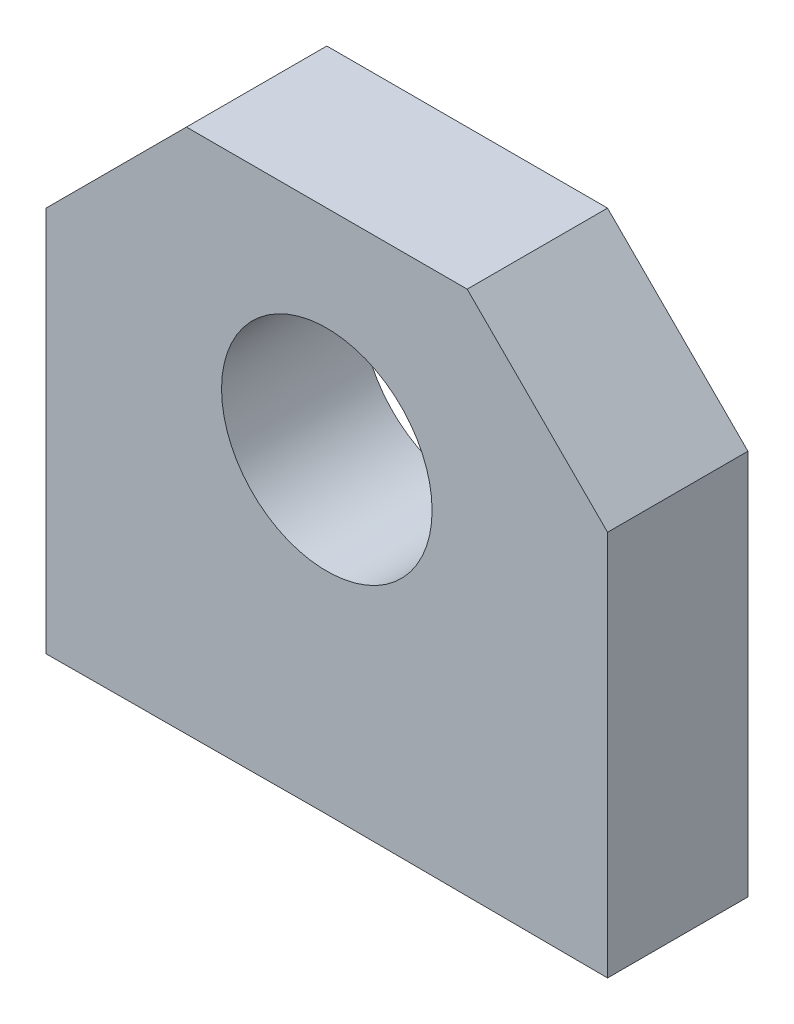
ISO-10303-21;
HEADER;
FILE_DESCRIPTION(('STEP AP214'),'2;1');
FILE_NAME('part.step','',(''),(''),'','','');
FILE_SCHEMA(('AUTOMOTIVE_DESIGN { 1 0 10303 214 1 1 1 1 }'));
ENDSEC;
DATA;
#1=APPLICATION_CONTEXT('core data for automotive mechanical design processes');
#2=APPLICATION_PROTOCOL_DEFINITION('international standard','automotive_design',2000,#1);
#3=PRODUCT_CONTEXT('',#1,'mechanical');
#4=PRODUCT('Part','Part','',(#3));
#5=PRODUCT_RELATED_PRODUCT_CATEGORY('part','',(#4));
#6=PRODUCT_DEFINITION_FORMATION('','',#4);
#7=PRODUCT_DEFINITION_CONTEXT('part definition',#1,'design');
#8=PRODUCT_DEFINITION('design','',#6,#7);
#9=PRODUCT_DEFINITION_SHAPE('','',#8);
#10=(LENGTH_UNIT() NAMED_UNIT(*) SI_UNIT(.MILLI.,.METRE.));
#11=(NAMED_UNIT(*) PLANE_ANGLE_UNIT() SI_UNIT($,.RADIAN.));
#12=(NAMED_UNIT(*) SI_UNIT($,.STERADIAN.) SOLID_ANGLE_UNIT());
#13=UNCERTAINTY_MEASURE_WITH_UNIT(LENGTH_MEASURE(1.E-05),#10,'distance_accuracy_value','');
#14=(GEOMETRIC_REPRESENTATION_CONTEXT(3) GLOBAL_UNCERTAINTY_ASSIGNED_CONTEXT((#13)) GLOBAL_UNIT_ASSIGNED_CONTEXT((#10,
#11,#12)) REPRESENTATION_CONTEXT('',''));
#15=CARTESIAN_POINT('',(0.,0.,0.));
#16=DIRECTION('',(0.,0.,1.));
#17=DIRECTION('',(1.,0.,0.));
#18=AXIS2_PLACEMENT_3D('',#15,#16,#17);
#19=CARTESIAN_POINT('',(16.,8.,8.));
#20=DIRECTION('',(0.,0.,1.));
#21=DIRECTION('',(1.,0.,0.));
#22=AXIS2_PLACEMENT_3D('',#19,#20,#21);
#23=PLANE('',#22);
#24=DIRECTION('',(0.999988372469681,-0.00482233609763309,0.));
#25=VECTOR('',#24,1.);
#26=CARTESIAN_POINT('',(0.,8.07715827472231,8.));
#27=LINE('',#26,#25);
#28=CARTESIAN_POINT('',(0.,8.07715827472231,8.));
#29=VERTEX_POINT('',#28);
#30=CARTESIAN_POINT('',(16.,8.,8.));
#31=VERTEX_POINT('',#30);
#32=EDGE_CURVE('E134',#29,#31,#27,.T.);
#33=ORIENTED_EDGE('',*,*,#32,.T.);
#34=DIRECTION('',(0.,1.,0.));
#35=VECTOR('',#34,1.);
#36=CARTESIAN_POINT('',(16.,8.,8.));
#37=LINE('',#36,#35);
#38=CARTESIAN_POINT('',(16.,30.,8.));
#39=VERTEX_POINT('',#38);
#40=EDGE_CURVE('E87',#31,#39,#37,.T.);
#41=ORIENTED_EDGE('',*,*,#40,.T.);
#42=DIRECTION('',(-0.707106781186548,0.707106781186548,0.));
#43=VECTOR('',#42,1.);
#44=CARTESIAN_POINT('',(16.,30.,8.));
#45=LINE('',#44,#43);
#46=CARTESIAN_POINT('',(8.,38.,8.));
#47=VERTEX_POINT('',#46);
#48=EDGE_CURVE('E146',#39,#47,#45,.T.);
#49=ORIENTED_EDGE('',*,*,#48,.T.);
#50=DIRECTION('',(-1.,0.,0.));
#51=VECTOR('',#50,1.);
#52=CARTESIAN_POINT('',(-8.,38.,8.));
#53=LINE('',#52,#51);
#54=CARTESIAN_POINT('',(-8.,38.,8.));
#55=VERTEX_POINT('',#54);
#56=EDGE_CURVE('E103',#47,#55,#53,.T.);
#57=ORIENTED_EDGE('',*,*,#56,.T.);
#58=DIRECTION('',(-0.707106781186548,-0.707106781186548,0.));
#59=VECTOR('',#58,1.);
#60=CARTESIAN_POINT('',(-16.,30.,8.));
#61=LINE('',#60,#59);
#62=CARTESIAN_POINT('',(-16.,30.,8.));
#63=VERTEX_POINT('',#62);
#64=EDGE_CURVE('E97',#55,#63,#61,.T.);
#65=ORIENTED_EDGE('',*,*,#64,.T.);
#66=DIRECTION('',(0.,-1.,0.));
#67=VECTOR('',#66,1.);
#68=CARTESIAN_POINT('',(-16.,8.,8.));
#69=LINE('',#68,#67);
#70=CARTESIAN_POINT('',(-16.,8.,8.));
#71=VERTEX_POINT('',#70);
#72=EDGE_CURVE('E101',#63,#71,#69,.T.);
#73=ORIENTED_EDGE('',*,*,#72,.T.);
#74=DIRECTION('',(0.999988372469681,0.00482233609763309,0.));
#75=VECTOR('',#74,1.);
#76=CARTESIAN_POINT('',(0.,8.07715827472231,8.));
#77=LINE('',#76,#75);
#78=EDGE_CURVE('E47',#71,#29,#77,.T.);
#79=ORIENTED_EDGE('',*,*,#78,.T.);
#80=EDGE_LOOP('',(#33,#41,#49,#57,#65,#73,#79));
#81=FACE_BOUND('',#80,.T.);
#82=CARTESIAN_POINT('',(0.,26.0771582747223,8.));
#83=DIRECTION('',(0.,0.,1.));
#84=DIRECTION('',(1.,0.,0.));
#85=AXIS2_PLACEMENT_3D('',#82,#83,#84);
#86=CIRCLE('',#85,6.);
#87=CARTESIAN_POINT('',(6.,26.0771582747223,8.));
#88=VERTEX_POINT('',#87);
#89=EDGE_CURVE('E125',#88,#88,#86,.T.);
#90=ORIENTED_EDGE('',*,*,#89,.F.);
#91=EDGE_LOOP('',(#90));
#92=FACE_BOUND('',#91,.T.);
#93=ADVANCED_FACE('F30',(#81,#92),#23,.T.);
#94=CARTESIAN_POINT('',(16.,8.,0.));
#95=DIRECTION('',(0.,0.,1.));
#96=DIRECTION('',(1.,0.,0.));
#97=AXIS2_PLACEMENT_3D('',#94,#95,#96);
#98=PLANE('',#97);
#99=DIRECTION('',(0.999988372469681,-0.00482233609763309,0.));
#100=VECTOR('',#99,1.);
#101=CARTESIAN_POINT('',(0.,8.07715827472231,0.));
#102=LINE('',#101,#100);
#103=CARTESIAN_POINT('',(0.,8.07715827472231,0.));
#104=VERTEX_POINT('',#103);
#105=CARTESIAN_POINT('',(16.,8.,0.));
#106=VERTEX_POINT('',#105);
#107=EDGE_CURVE('E121',#104,#106,#102,.T.);
#108=ORIENTED_EDGE('',*,*,#107,.F.);
#109=DIRECTION('',(0.999988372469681,0.00482233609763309,0.));
#110=VECTOR('',#109,1.);
#111=CARTESIAN_POINT('',(0.,8.07715827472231,0.));
#112=LINE('',#111,#110);
#113=CARTESIAN_POINT('',(-16.,8.,0.));
#114=VERTEX_POINT('',#113);
#115=EDGE_CURVE('E79',#114,#104,#112,.T.);
#116=ORIENTED_EDGE('',*,*,#115,.F.);
#117=DIRECTION('',(0.,-1.,0.));
#118=VECTOR('',#117,1.);
#119=CARTESIAN_POINT('',(-16.,8.,0.));
#120=LINE('',#119,#118);
#121=CARTESIAN_POINT('',(-16.,30.,0.));
#122=VERTEX_POINT('',#121);
#123=EDGE_CURVE('E73',#122,#114,#120,.T.);
#124=ORIENTED_EDGE('',*,*,#123,.F.);
#125=DIRECTION('',(-0.707106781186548,-0.707106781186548,0.));
#126=VECTOR('',#125,1.);
#127=CARTESIAN_POINT('',(-16.,30.,0.));
#128=LINE('',#127,#126);
#129=CARTESIAN_POINT('',(-8.,38.,0.));
#130=VERTEX_POINT('',#129);
#131=EDGE_CURVE('E111',#130,#122,#128,.T.);
#132=ORIENTED_EDGE('',*,*,#131,.F.);
#133=DIRECTION('',(-1.,0.,0.));
#134=VECTOR('',#133,1.);
#135=CARTESIAN_POINT('',(-8.,38.,0.));
#136=LINE('',#135,#134);
#137=CARTESIAN_POINT('',(8.,38.,0.));
#138=VERTEX_POINT('',#137);
#139=EDGE_CURVE('E129',#138,#130,#136,.T.);
#140=ORIENTED_EDGE('',*,*,#139,.F.);
#141=DIRECTION('',(-0.707106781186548,0.707106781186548,0.));
#142=VECTOR('',#141,1.);
#143=CARTESIAN_POINT('',(16.,30.,0.));
#144=LINE('',#143,#142);
#145=CARTESIAN_POINT('',(16.,30.,0.));
#146=VERTEX_POINT('',#145);
#147=EDGE_CURVE('E127',#146,#138,#144,.T.);
#148=ORIENTED_EDGE('',*,*,#147,.F.);
#149=DIRECTION('',(0.,1.,0.));
#150=VECTOR('',#149,1.);
#151=CARTESIAN_POINT('',(16.,8.,0.));
#152=LINE('',#151,#150);
#153=EDGE_CURVE('E124',#106,#146,#152,.T.);
#154=ORIENTED_EDGE('',*,*,#153,.F.);
#155=EDGE_LOOP('',(#108,#116,#124,#132,#140,#148,#154));
#156=FACE_BOUND('',#155,.T.);
#157=CARTESIAN_POINT('',(0.,26.0771582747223,0.));
#158=DIRECTION('',(0.,0.,1.));
#159=DIRECTION('',(1.,0.,0.));
#160=AXIS2_PLACEMENT_3D('',#157,#158,#159);
#161=CIRCLE('',#160,6.);
#162=CARTESIAN_POINT('',(6.,26.0771582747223,0.));
#163=VERTEX_POINT('',#162);
#164=EDGE_CURVE('E158',#163,#163,#161,.T.);
#165=ORIENTED_EDGE('',*,*,#164,.T.);
#166=EDGE_LOOP('',(#165));
#167=FACE_BOUND('',#166,.T.);
#168=ADVANCED_FACE('F150',(#156,#167),#98,.F.);
#169=CARTESIAN_POINT('',(0.,8.07715827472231,8.));
#170=DIRECTION('',(0.00482233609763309,0.999988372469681,0.));
#171=DIRECTION('',(-0.999988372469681,0.00482233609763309,0.));
#172=AXIS2_PLACEMENT_3D('',#169,#170,#171);
#173=PLANE('',#172);
#174=ORIENTED_EDGE('',*,*,#107,.T.);
#175=DIRECTION('',(0.,0.,-1.));
#176=VECTOR('',#175,1.);
#177=CARTESIAN_POINT('',(16.,8.,8.));
#178=LINE('',#177,#176);
#179=EDGE_CURVE('E11',#31,#106,#178,.T.);
#180=ORIENTED_EDGE('',*,*,#179,.F.);
#181=ORIENTED_EDGE('',*,*,#32,.F.);
#182=DIRECTION('',(0.,0.,-1.));
#183=VECTOR('',#182,1.);
#184=CARTESIAN_POINT('',(0.,8.07715827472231,8.));
#185=LINE('',#184,#183);
#186=EDGE_CURVE('E117',#29,#104,#185,.T.);
#187=ORIENTED_EDGE('',*,*,#186,.T.);
#188=EDGE_LOOP('',(#174,#180,#181,#187));
#189=FACE_BOUND('',#188,.T.);
#190=ADVANCED_FACE('F32',(#189),#173,.F.);
#191=CARTESIAN_POINT('',(16.,8.,8.));
#192=DIRECTION('',(-1.,0.,0.));
#193=DIRECTION('',(0.,0.,1.));
#194=AXIS2_PLACEMENT_3D('',#191,#192,#193);
#195=PLANE('',#194);
#196=ORIENTED_EDGE('',*,*,#153,.T.);
#197=DIRECTION('',(0.,0.,-1.));
#198=VECTOR('',#197,1.);
#199=CARTESIAN_POINT('',(16.,30.,8.));
#200=LINE('',#199,#198);
#201=EDGE_CURVE('E39',#39,#146,#200,.T.);
#202=ORIENTED_EDGE('',*,*,#201,.F.);
#203=ORIENTED_EDGE('',*,*,#40,.F.);
#204=ORIENTED_EDGE('',*,*,#179,.T.);
#205=EDGE_LOOP('',(#196,#202,#203,#204));
#206=FACE_BOUND('',#205,.T.);
#207=ADVANCED_FACE('F184',(#206),#195,.F.);
#208=CARTESIAN_POINT('',(16.,30.,8.));
#209=DIRECTION('',(-0.707106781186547,-0.707106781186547,0.));
#210=DIRECTION('',(0.707106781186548,-0.707106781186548,0.));
#211=AXIS2_PLACEMENT_3D('',#208,#209,#210);
#212=PLANE('',#211);
#213=ORIENTED_EDGE('',*,*,#147,.T.);
#214=DIRECTION('',(0.,0.,-1.));
#215=VECTOR('',#214,1.);
#216=CARTESIAN_POINT('',(8.,38.,8.));
#217=LINE('',#216,#215);
#218=EDGE_CURVE('E138',#47,#138,#217,.T.);
#219=ORIENTED_EDGE('',*,*,#218,.F.);
#220=ORIENTED_EDGE('',*,*,#48,.F.);
#221=ORIENTED_EDGE('',*,*,#201,.T.);
#222=EDGE_LOOP('',(#213,#219,#220,#221));
#223=FACE_BOUND('',#222,.T.);
#224=ADVANCED_FACE('F144',(#223),#212,.F.);
#225=CARTESIAN_POINT('',(-8.,38.,8.));
#226=DIRECTION('',(0.,-1.,0.));
#227=DIRECTION('',(0.,0.,-1.));
#228=AXIS2_PLACEMENT_3D('',#225,#226,#227);
#229=PLANE('',#228);
#230=ORIENTED_EDGE('',*,*,#139,.T.);
#231=DIRECTION('',(0.,0.,-1.));
#232=VECTOR('',#231,1.);
#233=CARTESIAN_POINT('',(-8.,38.,8.));
#234=LINE('',#233,#232);
#235=EDGE_CURVE('E112',#55,#130,#234,.T.);
#236=ORIENTED_EDGE('',*,*,#235,.F.);
#237=ORIENTED_EDGE('',*,*,#56,.F.);
#238=ORIENTED_EDGE('',*,*,#218,.T.);
#239=EDGE_LOOP('',(#230,#236,#237,#238));
#240=FACE_BOUND('',#239,.T.);
#241=ADVANCED_FACE('F153',(#240),#229,.F.);
#242=CARTESIAN_POINT('',(-16.,30.,8.));
#243=DIRECTION('',(0.707106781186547,-0.707106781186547,0.));
#244=DIRECTION('',(0.707106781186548,0.707106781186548,0.));
#245=AXIS2_PLACEMENT_3D('',#242,#243,#244);
#246=PLANE('',#245);
#247=ORIENTED_EDGE('',*,*,#131,.T.);
#248=DIRECTION('',(0.,0.,-1.));
#249=VECTOR('',#248,1.);
#250=CARTESIAN_POINT('',(-16.,30.,8.));
#251=LINE('',#250,#249);
#252=EDGE_CURVE('E108',#63,#122,#251,.T.);
#253=ORIENTED_EDGE('',*,*,#252,.F.);
#254=ORIENTED_EDGE('',*,*,#64,.F.);
#255=ORIENTED_EDGE('',*,*,#235,.T.);
#256=EDGE_LOOP('',(#247,#253,#254,#255));
#257=FACE_BOUND('',#256,.T.);
#258=ADVANCED_FACE('F109',(#257),#246,.F.);
#259=CARTESIAN_POINT('',(-16.,8.,8.));
#260=DIRECTION('',(1.,0.,0.));
#261=DIRECTION('',(0.,0.,-1.));
#262=AXIS2_PLACEMENT_3D('',#259,#260,#261);
#263=PLANE('',#262);
#264=ORIENTED_EDGE('',*,*,#123,.T.);
#265=DIRECTION('',(0.,0.,-1.));
#266=VECTOR('',#265,1.);
#267=CARTESIAN_POINT('',(-16.,8.,8.));
#268=LINE('',#267,#266);
#269=EDGE_CURVE('E113',#71,#114,#268,.T.);
#270=ORIENTED_EDGE('',*,*,#269,.F.);
#271=ORIENTED_EDGE('',*,*,#72,.F.);
#272=ORIENTED_EDGE('',*,*,#252,.T.);
#273=EDGE_LOOP('',(#264,#270,#271,#272));
#274=FACE_BOUND('',#273,.T.);
#275=ADVANCED_FACE('F115',(#274),#263,.F.);
#276=CARTESIAN_POINT('',(0.,8.07715827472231,8.));
#277=DIRECTION('',(-0.00482233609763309,0.999988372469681,0.));
#278=DIRECTION('',(-0.999988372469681,-0.00482233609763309,0.));
#279=AXIS2_PLACEMENT_3D('',#276,#277,#278);
#280=PLANE('',#279);
#281=ORIENTED_EDGE('',*,*,#115,.T.);
#282=ORIENTED_EDGE('',*,*,#186,.F.);
#283=ORIENTED_EDGE('',*,*,#78,.F.);
#284=ORIENTED_EDGE('',*,*,#269,.T.);
#285=EDGE_LOOP('',(#281,#282,#283,#284));
#286=FACE_BOUND('',#285,.T.);
#287=ADVANCED_FACE('F174',(#286),#280,.F.);
#288=CARTESIAN_POINT('',(0.,26.0771582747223,8.));
#289=DIRECTION('',(0.,0.,-1.));
#290=DIRECTION('',(-1.,0.,0.));
#291=AXIS2_PLACEMENT_3D('',#288,#289,#290);
#292=CYLINDRICAL_SURFACE('',#291,6.);
#293=ORIENTED_EDGE('',*,*,#89,.T.);
#294=EDGE_LOOP('',(#293));
#295=FACE_BOUND('',#294,.T.);
#296=ORIENTED_EDGE('',*,*,#164,.F.);
#297=EDGE_LOOP('',(#296));
#298=FACE_BOUND('',#297,.T.);
#299=ADVANCED_FACE('F164',(#295,#298),#292,.F.);
#300=CLOSED_SHELL('',(#93,#168,#190,#207,#224,#241,#258,#275,#287,#299));
#301=MANIFOLD_SOLID_BREP('B2',#300);
#302=ADVANCED_BREP_SHAPE_REPRESENTATION('',(#18,#301),#14);
#303=SHAPE_DEFINITION_REPRESENTATION(#9,#302);
ENDSEC;
END-ISO-10303-21;
